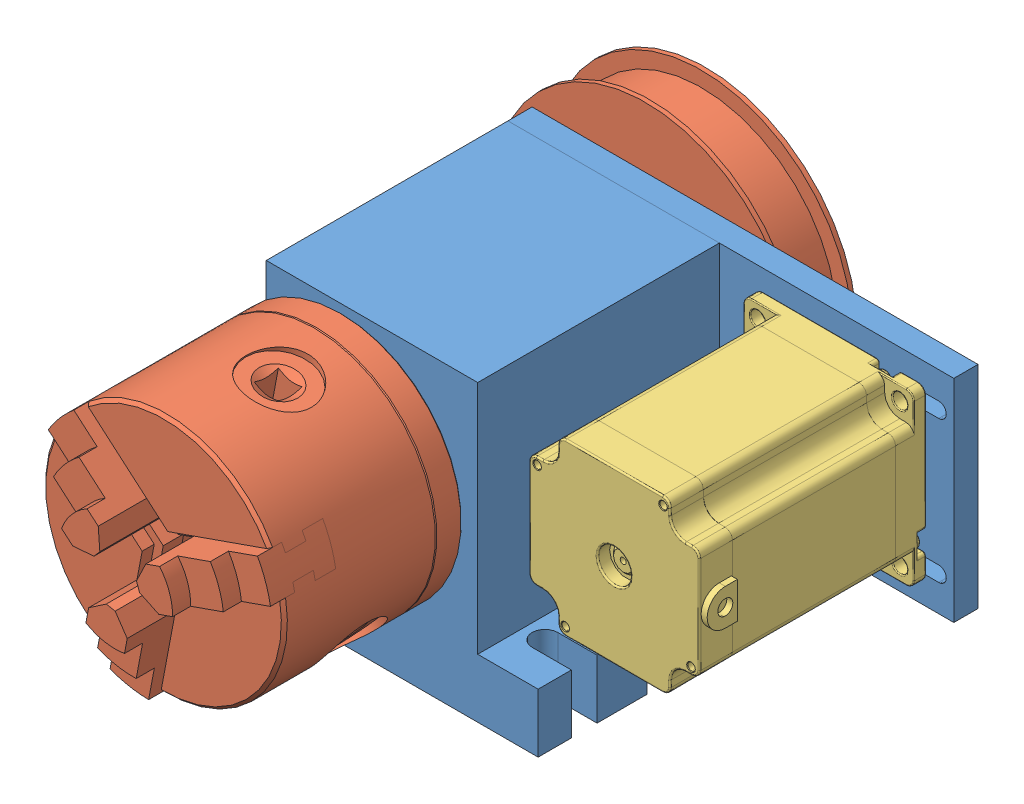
SolidWorks assembly A_axis_right.SLDASM, configuration Default (file format 6000). Lengths in mm.
Overall size (176.32 128.72 205).
3 component instances, 3 part files, 5 mates.
Components (placement in the parent):
- a axis braket-1: a axis braket.SLDPRT [Default] at (-26.2264 -44.1003 -0.483) size (167.6 97.4 88)
- chuck-1: chuck.SLDPRT [Default] at (-26.2264 20.8997 -40.483) x (-0.33063 0.943761 0) z (0 0 1) size (100 100 205)
- Stepper motor NEMA 23HS7430-1: Stepper motor NEMA 23HS7430.SLDPRT [По умолчанию] at (48.9236 18.2497 -40.483) size (58.4 56.4 95.6)
Mates (geometry in assembly coordinates):
- Coincident1: coincident anti-aligned: plane of a axis braket-1 through (-26.2264 -44.1003 -40.483) normal (0 0 1); plane of chuck-1 through (-26.2264 20.8997 -40.483) normal (0 0 -1)
- Concentric1: concentric anti-aligned: cylinder of a axis braket-1 through (-26.2264 20.8997 -40.4831) axis (0 0 1) radius 22.5; cylinder of chuck-1 through (-26.2264 20.8997 39.517) axis (0 0 -1) radius 22.5
- Concentric3: concentric: circle of a axis braket-1; circle of Stepper motor NEMA 23HS7430-1
- Coincident5: coincident: plane of a axis braket-1 through (-26.2264 -44.1003 -40.483) normal (0 0 1); plane of Stepper motor NEMA 23HS7430-1 through (48.9236 18.2497 -40.483) normal (0 0 -1)
- Parallel1: parallel aligned: plane of a axis braket-1 through (-61.2264 53.2997 -48.483) normal (0 1 0); plane of Stepper motor NEMA 23HS7430-1 through (64.9736 46.4497 23.517) normal (0 1 0)
